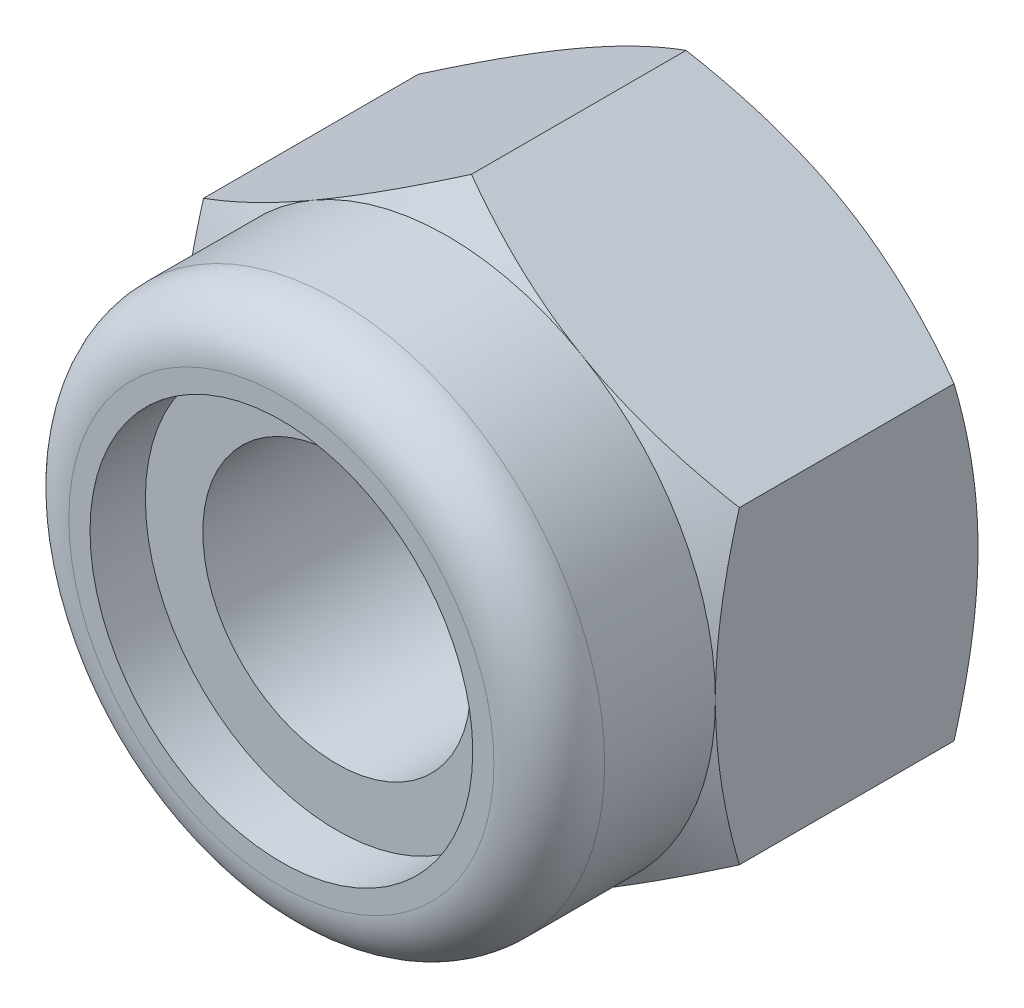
ISO-10303-21;
HEADER;
FILE_DESCRIPTION(('STEP AP214'),'2;1');
FILE_NAME('part.step','',(''),(''),'','','');
FILE_SCHEMA(('AUTOMOTIVE_DESIGN { 1 0 10303 214 1 1 1 1 }'));
ENDSEC;
DATA;
#1=APPLICATION_CONTEXT('core data for automotive mechanical design processes');
#2=APPLICATION_PROTOCOL_DEFINITION('international standard','automotive_design',2000,#1);
#3=PRODUCT_CONTEXT('',#1,'mechanical');
#4=PRODUCT('Part','Part','',(#3));
#5=PRODUCT_RELATED_PRODUCT_CATEGORY('part','',(#4));
#6=PRODUCT_DEFINITION_FORMATION('','',#4);
#7=PRODUCT_DEFINITION_CONTEXT('part definition',#1,'design');
#8=PRODUCT_DEFINITION('design','',#6,#7);
#9=PRODUCT_DEFINITION_SHAPE('','',#8);
#10=(LENGTH_UNIT() NAMED_UNIT(*) SI_UNIT(.MILLI.,.METRE.));
#11=(NAMED_UNIT(*) PLANE_ANGLE_UNIT() SI_UNIT($,.RADIAN.));
#12=(NAMED_UNIT(*) SI_UNIT($,.STERADIAN.) SOLID_ANGLE_UNIT());
#13=UNCERTAINTY_MEASURE_WITH_UNIT(LENGTH_MEASURE(1.E-05),#10,'distance_accuracy_value','');
#14=(GEOMETRIC_REPRESENTATION_CONTEXT(3) GLOBAL_UNCERTAINTY_ASSIGNED_CONTEXT((#13)) GLOBAL_UNIT_ASSIGNED_CONTEXT((#10,
#11,#12)) REPRESENTATION_CONTEXT('',''));
#15=CARTESIAN_POINT('',(0.,0.,0.));
#16=DIRECTION('',(0.,0.,1.));
#17=DIRECTION('',(1.,0.,0.));
#18=AXIS2_PLACEMENT_3D('',#15,#16,#17);
#19=CARTESIAN_POINT('',(0.,0.,-4.9));
#20=DIRECTION('',(0.,0.,1.));
#21=DIRECTION('',(1.,0.,0.));
#22=AXIS2_PLACEMENT_3D('',#19,#20,#21);
#23=CYLINDRICAL_SURFACE('',#22,2.5);
#24=CARTESIAN_POINT('',(0.,0.,2.06666666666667));
#25=DIRECTION('',(0.,0.,1.));
#26=DIRECTION('',(1.,0.,0.));
#27=AXIS2_PLACEMENT_3D('',#24,#25,#26);
#28=CIRCLE('',#27,2.5);
#29=CARTESIAN_POINT('',(2.5,0.,2.06666666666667));
#30=VERTEX_POINT('',#29);
#31=EDGE_CURVE('E274',#30,#30,#28,.T.);
#32=ORIENTED_EDGE('',*,*,#31,.T.);
#33=EDGE_LOOP('',(#32));
#34=FACE_BOUND('',#33,.T.);
#35=CARTESIAN_POINT('',(0.,0.,-4.52449623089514));
#36=DIRECTION('',(0.,0.,-1.));
#37=DIRECTION('',(-1.,0.,0.));
#38=AXIS2_PLACEMENT_3D('',#35,#36,#37);
#39=CIRCLE('',#38,2.5);
#40=CARTESIAN_POINT('',(-2.5,0.,-4.52449623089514));
#41=VERTEX_POINT('',#40);
#42=EDGE_CURVE('E41',#41,#41,#39,.F.);
#43=ORIENTED_EDGE('',*,*,#42,.F.);
#44=EDGE_LOOP('',(#43));
#45=FACE_BOUND('',#44,.T.);
#46=ADVANCED_FACE('F36',(#34,#45),#23,.F.);
#47=CARTESIAN_POINT('',(0.,5.77350269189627,-4.9));
#48=DIRECTION('',(0.,0.,-1.));
#49=DIRECTION('',(-1.,0.,0.));
#50=AXIS2_PLACEMENT_3D('',#47,#48,#49);
#51=PLANE('',#50);
#52=CARTESIAN_POINT('',(0.,0.,-4.9));
#53=DIRECTION('',(0.,0.,-1.));
#54=DIRECTION('',(-1.,0.,0.));
#55=AXIS2_PLACEMENT_3D('',#52,#53,#54);
#56=CIRCLE('',#55,5.);
#57=CARTESIAN_POINT('',(-5.,0.,-4.9));
#58=VERTEX_POINT('',#57);
#59=CARTESIAN_POINT('',(-2.50000000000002,-4.33012701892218,-4.9));
#60=VERTEX_POINT('',#59);
#61=EDGE_CURVE('E146',#58,#60,#56,.F.);
#62=ORIENTED_EDGE('',*,*,#61,.F.);
#63=CARTESIAN_POINT('',(-2.50000000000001,4.33012701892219,-4.9));
#64=VERTEX_POINT('',#63);
#65=EDGE_CURVE('E236',#64,#58,#56,.F.);
#66=ORIENTED_EDGE('',*,*,#65,.F.);
#67=CARTESIAN_POINT('',(2.50000000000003,4.33012701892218,-4.9));
#68=VERTEX_POINT('',#67);
#69=EDGE_CURVE('E251',#68,#64,#56,.F.);
#70=ORIENTED_EDGE('',*,*,#69,.F.);
#71=CARTESIAN_POINT('',(0.,0.,-4.9));
#72=DIRECTION('',(0.,0.,1.));
#73=DIRECTION('',(1.,0.,0.));
#74=AXIS2_PLACEMENT_3D('',#71,#72,#73);
#75=CIRCLE('',#74,5.);
#76=CARTESIAN_POINT('',(5.,0.,-4.9));
#77=VERTEX_POINT('',#76);
#78=EDGE_CURVE('E208',#77,#68,#75,.T.);
#79=ORIENTED_EDGE('',*,*,#78,.F.);
#80=CARTESIAN_POINT('',(2.50000000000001,-4.33012701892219,-4.9));
#81=VERTEX_POINT('',#80);
#82=EDGE_CURVE('E405',#81,#77,#56,.F.);
#83=ORIENTED_EDGE('',*,*,#82,.F.);
#84=EDGE_CURVE('E323',#60,#81,#56,.F.);
#85=ORIENTED_EDGE('',*,*,#84,.F.);
#86=EDGE_LOOP('',(#62,#66,#70,#79,#83,#85));
#87=FACE_BOUND('',#86,.T.);
#88=CARTESIAN_POINT('',(0.,0.,-4.9));
#89=DIRECTION('',(0.,0.,-1.));
#90=DIRECTION('',(-1.,0.,0.));
#91=AXIS2_PLACEMENT_3D('',#88,#89,#90);
#92=CIRCLE('',#91,3.);
#93=CARTESIAN_POINT('',(-3.,0.,-4.9));
#94=VERTEX_POINT('',#93);
#95=EDGE_CURVE('E252',#94,#94,#92,.F.);
#96=ORIENTED_EDGE('',*,*,#95,.T.);
#97=EDGE_LOOP('',(#96));
#98=FACE_BOUND('',#97,.T.);
#99=ADVANCED_FACE('F216',(#87,#98),#51,.T.);
#100=CARTESIAN_POINT('',(0.,5.77350269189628,-4.9));
#101=DIRECTION('',(-0.500000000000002,0.866025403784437,0.));
#102=DIRECTION('',(-0.866025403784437,-0.500000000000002,0.));
#103=AXIS2_PLACEMENT_3D('',#100,#101,#102);
#104=PLANE('',#103);
#105=DIRECTION('',(0.,0.,1.));
#106=VECTOR('',#105,1.);
#107=CARTESIAN_POINT('',(-5.,2.88675134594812,-4.9));
#108=LINE('',#107,#106);
#109=CARTESIAN_POINT('',(-5.,2.88675134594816,-4.45341801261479));
#110=VERTEX_POINT('',#109);
#111=CARTESIAN_POINT('',(-5.,2.88675134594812,-0.446581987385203));
#112=VERTEX_POINT('',#111);
#113=EDGE_CURVE('E247',#110,#112,#108,.T.);
#114=ORIENTED_EDGE('',*,*,#113,.T.);
#115=CARTESIAN_POINT('',(-5.0002,2.88663587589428,-0.44664865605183));
#116=CARTESIAN_POINT('',(-4.78046540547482,3.01349970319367,-0.373386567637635));
#117=CARTESIAN_POINT('',(-4.55885141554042,3.14144859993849,-0.306751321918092));
#118=CARTESIAN_POINT('',(-4.11178600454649,3.3995619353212,-0.190438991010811));
#119=CARTESIAN_POINT('',(-3.88632664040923,3.52973095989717,-0.140803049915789));
#120=CARTESIAN_POINT('',(-3.43816769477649,3.78847564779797,-0.063551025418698));
#121=CARTESIAN_POINT('',(-3.21553790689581,3.91701101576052,-0.0354203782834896));
#122=CARTESIAN_POINT('',(-2.88081009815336,4.11026620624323,-0.0101949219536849));
#123=CARTESIAN_POINT('',(-2.76915780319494,4.17472868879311,-0.0046134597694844));
#124=CARTESIAN_POINT('',(-2.5457500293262,4.30371322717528,0.000797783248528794));
#125=CARTESIAN_POINT('',(-2.43399455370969,4.36823528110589,0.000627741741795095));
#126=CARTESIAN_POINT('',(-2.12781576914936,4.54500768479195,-0.00775363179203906));
#127=CARTESIAN_POINT('',(-1.93349391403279,4.65719946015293,-0.0218297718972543));
#128=CARTESIAN_POINT('',(-1.54613989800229,4.88083840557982,-0.0664652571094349));
#129=CARTESIAN_POINT('',(-1.35310909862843,4.99228478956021,-0.0970398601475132));
#130=CARTESIAN_POINT('',(-0.96497465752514,5.21637431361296,-0.173468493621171));
#131=CARTESIAN_POINT('',(-0.769920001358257,5.3289891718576,-0.219646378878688));
#132=CARTESIAN_POINT('',(-0.382719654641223,5.552539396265,-0.324451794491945));
#133=CARTESIAN_POINT('',(-0.190569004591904,5.66347762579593,-0.383054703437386));
#134=CARTESIAN_POINT('',(0.000200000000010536,5.77361816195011,-0.446648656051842));
#135=B_SPLINE_CURVE_WITH_KNOTS('',3,(#115,#116,#117,#118,#119,#120,#121,#122,#123,#124,#125,
#126,#127,#128,#129,#130,#131,#132,#133,#134),.UNSPECIFIED.,.F.,.F.,(4,2,2,2,2,2,2,2,2,4),(0.,
0.792555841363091,1.58701660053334,2.36181537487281,2.74884076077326,3.13585419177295,
3.8096236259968,4.48401723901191,5.17336882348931,5.86136694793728),.UNSPECIFIED.);
#136=CARTESIAN_POINT('',(-2.50000000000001,4.33012701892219,0.));
#137=VERTEX_POINT('',#136);
#138=EDGE_CURVE('E61',#112,#137,#135,.T.);
#139=ORIENTED_EDGE('',*,*,#138,.T.);
#140=CARTESIAN_POINT('',(0.,5.77350269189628,-0.446581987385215));
#141=VERTEX_POINT('',#140);
#142=EDGE_CURVE('E199',#137,#141,#135,.T.);
#143=ORIENTED_EDGE('',*,*,#142,.T.);
#144=DIRECTION('',(0.,0.,1.));
#145=VECTOR('',#144,1.);
#146=CARTESIAN_POINT('',(0.,5.77350269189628,-4.9));
#147=LINE('',#146,#145);
#148=CARTESIAN_POINT('',(0.,5.77350269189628,-4.45341801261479));
#149=VERTEX_POINT('',#148);
#150=EDGE_CURVE('E233',#149,#141,#147,.T.);
#151=ORIENTED_EDGE('',*,*,#150,.F.);
#152=CARTESIAN_POINT('',(-5.0002,2.88663587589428,-4.45335134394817));
#153=CARTESIAN_POINT('',(-4.78046540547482,3.01349970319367,-4.52661343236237));
#154=CARTESIAN_POINT('',(-4.55885141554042,3.14144859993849,-4.59324867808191));
#155=CARTESIAN_POINT('',(-4.11178600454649,3.3995619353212,-4.70956100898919));
#156=CARTESIAN_POINT('',(-3.88632664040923,3.52973095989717,-4.75919695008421));
#157=CARTESIAN_POINT('',(-3.43816769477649,3.78847564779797,-4.8364489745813));
#158=CARTESIAN_POINT('',(-3.21553790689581,3.91701101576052,-4.86457962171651));
#159=CARTESIAN_POINT('',(-2.88081009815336,4.11026620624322,-4.88980507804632));
#160=CARTESIAN_POINT('',(-2.76915780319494,4.17472868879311,-4.89538654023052));
#161=CARTESIAN_POINT('',(-2.5457500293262,4.30371322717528,-4.90079778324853));
#162=CARTESIAN_POINT('',(-2.43399455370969,4.36823528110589,-4.9006277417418));
#163=CARTESIAN_POINT('',(-2.12781576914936,4.54500768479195,-4.89224636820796));
#164=CARTESIAN_POINT('',(-1.93349391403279,4.65719946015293,-4.87817022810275));
#165=CARTESIAN_POINT('',(-1.54613989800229,4.88083840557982,-4.83353474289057));
#166=CARTESIAN_POINT('',(-1.35310909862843,4.99228478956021,-4.80296013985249));
#167=CARTESIAN_POINT('',(-0.96497465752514,5.21637431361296,-4.72653150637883));
#168=CARTESIAN_POINT('',(-0.769920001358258,5.3289891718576,-4.68035362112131));
#169=CARTESIAN_POINT('',(-0.382719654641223,5.552539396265,-4.57554820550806));
#170=CARTESIAN_POINT('',(-0.190569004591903,5.66347762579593,-4.51694529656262));
#171=CARTESIAN_POINT('',(0.000200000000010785,5.77361816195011,-4.45335134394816));
#172=B_SPLINE_CURVE_WITH_KNOTS('',3,(#152,#153,#154,#155,#156,#157,#158,#159,#160,#161,#162,
#163,#164,#165,#166,#167,#168,#169,#170,#171),.UNSPECIFIED.,.F.,.F.,(4,2,2,2,2,2,2,2,2,4),(0.,
0.792555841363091,1.58701660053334,2.36181537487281,2.74884076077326,3.13585419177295,
3.8096236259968,4.48401723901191,5.1733688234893,5.86136694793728),.UNSPECIFIED.);
#173=EDGE_CURVE('E249',#64,#149,#172,.T.);
#174=ORIENTED_EDGE('',*,*,#173,.F.);
#175=EDGE_CURVE('E228',#110,#64,#172,.T.);
#176=ORIENTED_EDGE('',*,*,#175,.F.);
#177=EDGE_LOOP('',(#114,#139,#143,#151,#174,#176));
#178=FACE_BOUND('',#177,.T.);
#179=ADVANCED_FACE('F38',(#178),#104,.T.);
#180=CARTESIAN_POINT('',(5.,2.8867513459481,-4.9));
#181=DIRECTION('',(0.500000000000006,0.866025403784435,0.));
#182=DIRECTION('',(-0.866025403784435,0.500000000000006,0.));
#183=AXIS2_PLACEMENT_3D('',#180,#181,#182);
#184=PLANE('',#183);
#185=ORIENTED_EDGE('',*,*,#150,.T.);
#186=CARTESIAN_POINT('',(-0.000199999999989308,5.77361816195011,-0.446648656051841));
#187=CARTESIAN_POINT('',(0.219534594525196,5.64675433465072,-0.373386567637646));
#188=CARTESIAN_POINT('',(0.441148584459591,5.51880543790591,-0.306751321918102));
#189=CARTESIAN_POINT('',(0.888213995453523,5.26069210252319,-0.190438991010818));
#190=CARTESIAN_POINT('',(1.11367335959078,5.13052307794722,-0.140803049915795));
#191=CARTESIAN_POINT('',(1.56183230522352,4.87177839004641,-0.0635510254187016));
#192=CARTESIAN_POINT('',(1.7844620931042,4.74324302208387,-0.0354203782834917));
#193=CARTESIAN_POINT('',(2.11918990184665,4.54998783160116,-0.0101949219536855));
#194=CARTESIAN_POINT('',(2.23084219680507,4.48552534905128,-0.00461345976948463));
#195=CARTESIAN_POINT('',(2.45424997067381,4.35654081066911,0.000797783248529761));
#196=CARTESIAN_POINT('',(2.56600544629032,4.29201875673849,0.000627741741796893));
#197=CARTESIAN_POINT('',(2.87218423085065,4.11524635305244,-0.00775363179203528));
#198=CARTESIAN_POINT('',(3.06650608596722,4.00305457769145,-0.0218297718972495));
#199=CARTESIAN_POINT('',(3.45386010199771,3.77941563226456,-0.0664652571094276));
#200=CARTESIAN_POINT('',(3.64689090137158,3.66796924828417,-0.0970398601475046));
#201=CARTESIAN_POINT('',(4.03502534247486,3.44387972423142,-0.17346849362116));
#202=CARTESIAN_POINT('',(4.23007999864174,3.33126486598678,-0.219646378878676));
#203=CARTESIAN_POINT('',(4.61728034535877,3.10771464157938,-0.324451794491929));
#204=CARTESIAN_POINT('',(4.80943099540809,2.99677641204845,-0.383054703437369));
#205=CARTESIAN_POINT('',(5.0002,2.88663587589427,-0.446648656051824));
#206=B_SPLINE_CURVE_WITH_KNOTS('',3,(#186,#187,#188,#189,#190,#191,#192,#193,#194,#195,#196,
#197,#198,#199,#200,#201,#202,#203,#204,#205),.UNSPECIFIED.,.F.,.F.,(4,2,2,2,2,2,2,2,2,4),(0.,
0.792555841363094,1.58701660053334,2.36181537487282,2.74884076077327,3.13585419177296,
3.8096236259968,4.48401723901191,5.1733688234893,5.86136694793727),.UNSPECIFIED.);
#207=CARTESIAN_POINT('',(2.50000000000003,4.33012701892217,0.));
#208=VERTEX_POINT('',#207);
#209=EDGE_CURVE('E207',#141,#208,#206,.T.);
#210=ORIENTED_EDGE('',*,*,#209,.T.);
#211=CARTESIAN_POINT('',(5.,2.88675134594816,-0.446581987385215));
#212=VERTEX_POINT('',#211);
#213=EDGE_CURVE('E200',#208,#212,#206,.T.);
#214=ORIENTED_EDGE('',*,*,#213,.T.);
#215=DIRECTION('',(0.,0.,1.));
#216=VECTOR('',#215,1.);
#217=CARTESIAN_POINT('',(5.,2.8867513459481,-4.9));
#218=LINE('',#217,#216);
#219=CARTESIAN_POINT('',(5.,2.88675134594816,-4.45341801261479));
#220=VERTEX_POINT('',#219);
#221=EDGE_CURVE('E237',#220,#212,#218,.T.);
#222=ORIENTED_EDGE('',*,*,#221,.F.);
#223=CARTESIAN_POINT('',(-0.000199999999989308,5.77361816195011,-4.45335134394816));
#224=CARTESIAN_POINT('',(0.219534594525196,5.64675433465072,-4.52661343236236));
#225=CARTESIAN_POINT('',(0.441148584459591,5.51880543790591,-4.5932486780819));
#226=CARTESIAN_POINT('',(0.888213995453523,5.26069210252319,-4.70956100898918));
#227=CARTESIAN_POINT('',(1.11367335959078,5.13052307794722,-4.75919695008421));
#228=CARTESIAN_POINT('',(1.56183230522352,4.87177839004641,-4.8364489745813));
#229=CARTESIAN_POINT('',(1.7844620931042,4.74324302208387,-4.86457962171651));
#230=CARTESIAN_POINT('',(2.11918990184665,4.54998783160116,-4.88980507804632));
#231=CARTESIAN_POINT('',(2.23084219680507,4.48552534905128,-4.89538654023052));
#232=CARTESIAN_POINT('',(2.45424997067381,4.35654081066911,-4.90079778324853));
#233=CARTESIAN_POINT('',(2.56600544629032,4.29201875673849,-4.9006277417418));
#234=CARTESIAN_POINT('',(2.87218423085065,4.11524635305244,-4.89224636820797));
#235=CARTESIAN_POINT('',(3.06650608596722,4.00305457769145,-4.87817022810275));
#236=CARTESIAN_POINT('',(3.45386010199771,3.77941563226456,-4.83353474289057));
#237=CARTESIAN_POINT('',(3.64689090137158,3.66796924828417,-4.8029601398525));
#238=CARTESIAN_POINT('',(4.03502534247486,3.44387972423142,-4.72653150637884));
#239=CARTESIAN_POINT('',(4.23007999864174,3.33126486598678,-4.68035362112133));
#240=CARTESIAN_POINT('',(4.61728034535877,3.10771464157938,-4.57554820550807));
#241=CARTESIAN_POINT('',(4.80943099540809,2.99677641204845,-4.51694529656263));
#242=CARTESIAN_POINT('',(5.0002,2.88663587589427,-4.45335134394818));
#243=B_SPLINE_CURVE_WITH_KNOTS('',3,(#223,#224,#225,#226,#227,#228,#229,#230,#231,#232,#233,
#234,#235,#236,#237,#238,#239,#240,#241,#242),.UNSPECIFIED.,.F.,.F.,(4,2,2,2,2,2,2,2,2,4),(0.,
0.792555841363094,1.58701660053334,2.36181537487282,2.74884076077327,3.13585419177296,
3.8096236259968,4.48401723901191,5.1733688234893,5.86136694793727),.UNSPECIFIED.);
#244=EDGE_CURVE('E220',#68,#220,#243,.T.);
#245=ORIENTED_EDGE('',*,*,#244,.F.);
#246=EDGE_CURVE('E226',#149,#68,#243,.T.);
#247=ORIENTED_EDGE('',*,*,#246,.F.);
#248=EDGE_LOOP('',(#185,#210,#214,#222,#245,#247));
#249=FACE_BOUND('',#248,.T.);
#250=ADVANCED_FACE('F210',(#249),#184,.T.);
#251=CARTESIAN_POINT('',(5.,2.8867513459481,-4.9));
#252=DIRECTION('',(-1.,0.,0.));
#253=DIRECTION('',(0.,0.,1.));
#254=AXIS2_PLACEMENT_3D('',#251,#252,#253);
#255=PLANE('',#254);
#256=CARTESIAN_POINT('',(5.,-7.65608998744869,-2.39263352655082));
#257=CARTESIAN_POINT('',(5.,-7.4365617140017,-2.28654533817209));
#258=CARTESIAN_POINT('',(5.,-7.21651440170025,-2.18151175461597));
#259=CARTESIAN_POINT('',(5.,-6.77510105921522,-1.97415643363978));
#260=CARTESIAN_POINT('',(5.,-6.55373480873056,-1.8718351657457));
#261=CARTESIAN_POINT('',(5.,-6.1082071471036,-1.66996807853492));
#262=CARTESIAN_POINT('',(5.,-5.88403698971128,-1.57044149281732));
#263=CARTESIAN_POINT('',(5.,-5.4338541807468,-1.37566323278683));
#264=CARTESIAN_POINT('',(5.,-5.20784162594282,-1.28041133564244));
#265=CARTESIAN_POINT('',(5.,-4.75080884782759,-1.09418830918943));
#266=CARTESIAN_POINT('',(5.,-4.51976121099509,-1.00328409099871));
#267=CARTESIAN_POINT('',(5.,-4.05494053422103,-0.828595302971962));
#268=CARTESIAN_POINT('',(5.,-3.82116719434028,-0.744811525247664));
#269=CARTESIAN_POINT('',(5.,-3.35100416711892,-0.58661463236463));
#270=CARTESIAN_POINT('',(5.,-3.11462125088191,-0.512181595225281));
#271=CARTESIAN_POINT('',(5.,-2.63849247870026,-0.375104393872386));
#272=CARTESIAN_POINT('',(5.,-2.39874771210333,-0.312456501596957));
#273=CARTESIAN_POINT('',(5.,-1.915743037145,-0.201987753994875));
#274=CARTESIAN_POINT('',(5.,-1.67248221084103,-0.154170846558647));
#275=CARTESIAN_POINT('',(5.,-1.18299359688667,-0.0765955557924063));
#276=CARTESIAN_POINT('',(5.,-0.936765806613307,-0.0468371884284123));
#277=CARTESIAN_POINT('',(5.,-0.567032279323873,-0.0176512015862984));
#278=CARTESIAN_POINT('',(5.,-0.444105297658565,-0.0104963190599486));
#279=CARTESIAN_POINT('',(5.,-0.19805300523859,-0.00139545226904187));
#280=CARTESIAN_POINT('',(5.,-0.0749276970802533,0.000550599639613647));
#281=CARTESIAN_POINT('',(5.,0.171257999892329,-0.000818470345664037));
#282=CARTESIAN_POINT('',(5.,0.294318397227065,-0.00413211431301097));
#283=CARTESIAN_POINT('',(5.,0.540192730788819,-0.0159365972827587));
#284=CARTESIAN_POINT('',(5.,0.663006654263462,-0.0244276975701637));
#285=CARTESIAN_POINT('',(5.,0.960681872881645,-0.0511063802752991));
#286=CARTESIAN_POINT('',(5.,1.13531436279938,-0.071888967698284));
#287=CARTESIAN_POINT('',(5.,1.48321675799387,-0.122765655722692));
#288=CARTESIAN_POINT('',(5.,1.65648647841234,-0.15286099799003));
#289=CARTESIAN_POINT('',(5.,2.00155426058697,-0.221298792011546));
#290=CARTESIAN_POINT('',(5.,2.17335067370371,-0.259649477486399));
#291=CARTESIAN_POINT('',(5.,2.51518168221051,-0.343428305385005));
#292=CARTESIAN_POINT('',(5.,2.68521638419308,-0.388856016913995));
#293=CARTESIAN_POINT('',(5.,3.02770318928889,-0.486887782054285));
#294=CARTESIAN_POINT('',(5.,3.20011248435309,-0.539640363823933));
#295=CARTESIAN_POINT('',(5.,3.54310870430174,-0.650357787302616));
#296=CARTESIAN_POINT('',(5.,3.71369679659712,-0.70831903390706));
#297=CARTESIAN_POINT('',(5.,4.05236610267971,-0.828256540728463));
#298=CARTESIAN_POINT('',(5.,4.22045602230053,-0.890208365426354));
#299=CARTESIAN_POINT('',(5.,4.55533171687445,-1.01774823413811));
#300=CARTESIAN_POINT('',(5.,4.72211693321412,-1.08333774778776));
#301=CARTESIAN_POINT('',(5.,4.88829623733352,-1.15038625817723));
#302=B_SPLINE_CURVE_WITH_KNOTS('',3,(#256,#257,#258,#259,#260,#261,#262,#263,#264,#265,#266,
#267,#268,#269,#270,#271,#272,#273,#274,#275,#276,#277,#278,#279,#280,#281,#282,#283,#284,#285,
#286,#287,#288,#289,#290,#291,#292,#293,#294,#295,#296,#297,#298,#299,#300,#301),.UNSPECIFIED.,
.F.,.F.,(4,2,2,2,2,2,2,2,2,2,2,2,2,2,2,2,2,2,2,2,2,2,4),(0.,0.731464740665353,1.46305528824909,
2.19883243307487,2.93457117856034,3.67934251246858,4.42419659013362,5.1674358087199,
5.9104395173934,6.65364083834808,7.39684281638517,7.76615414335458,8.13546067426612,
8.50466345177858,8.87388486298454,9.40118542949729,9.92855633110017,10.4564556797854,
10.9843228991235,11.525120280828,12.065547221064,12.6029322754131,13.1405360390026),.UNSPECIFIED.);
#303=CARTESIAN_POINT('',(5.,-2.88675134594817,-0.446581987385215));
#304=VERTEX_POINT('',#303);
#305=CARTESIAN_POINT('',(5.,0.,0.));
#306=VERTEX_POINT('',#305);
#307=EDGE_CURVE('E189',#304,#306,#302,.T.);
#308=ORIENTED_EDGE('',*,*,#307,.F.);
#309=DIRECTION('',(0.,0.,1.));
#310=VECTOR('',#309,1.);
#311=CARTESIAN_POINT('',(5.,-2.88675134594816,-4.9));
#312=LINE('',#311,#310);
#313=CARTESIAN_POINT('',(5.,-2.88675134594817,-4.45341801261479));
#314=VERTEX_POINT('',#313);
#315=EDGE_CURVE('E240',#314,#304,#312,.T.);
#316=ORIENTED_EDGE('',*,*,#315,.F.);
#317=CARTESIAN_POINT('',(5.,-7.65608998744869,-2.50736647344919));
#318=CARTESIAN_POINT('',(5.,-7.4365617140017,-2.61345466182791));
#319=CARTESIAN_POINT('',(5.,-7.21651440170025,-2.71848824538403));
#320=CARTESIAN_POINT('',(5.,-6.77510105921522,-2.92584356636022));
#321=CARTESIAN_POINT('',(5.,-6.55373480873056,-3.0281648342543));
#322=CARTESIAN_POINT('',(5.,-6.10820714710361,-3.23003192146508));
#323=CARTESIAN_POINT('',(5.,-5.88403698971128,-3.32955850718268));
#324=CARTESIAN_POINT('',(5.,-5.43385418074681,-3.52433676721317));
#325=CARTESIAN_POINT('',(5.,-5.20784162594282,-3.61958866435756));
#326=CARTESIAN_POINT('',(5.,-4.75080884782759,-3.80581169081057));
#327=CARTESIAN_POINT('',(5.,-4.51976121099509,-3.89671590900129));
#328=CARTESIAN_POINT('',(5.,-4.05494053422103,-4.07140469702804));
#329=CARTESIAN_POINT('',(5.,-3.82116719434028,-4.15518847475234));
#330=CARTESIAN_POINT('',(5.,-3.35100416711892,-4.31338536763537));
#331=CARTESIAN_POINT('',(5.,-3.11462125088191,-4.38781840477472));
#332=CARTESIAN_POINT('',(5.,-2.63849247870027,-4.52489560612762));
#333=CARTESIAN_POINT('',(5.,-2.39874771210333,-4.58754349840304));
#334=CARTESIAN_POINT('',(5.,-1.915743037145,-4.69801224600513));
#335=CARTESIAN_POINT('',(5.,-1.67248221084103,-4.74582915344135));
#336=CARTESIAN_POINT('',(5.,-1.18299359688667,-4.8234044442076));
#337=CARTESIAN_POINT('',(5.,-0.936765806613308,-4.85316281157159));
#338=CARTESIAN_POINT('',(5.,-0.567032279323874,-4.8823487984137));
#339=CARTESIAN_POINT('',(5.,-0.444105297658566,-4.88950368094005));
#340=CARTESIAN_POINT('',(5.,-0.19805300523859,-4.89860454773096));
#341=CARTESIAN_POINT('',(5.,-0.0749276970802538,-4.90055059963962));
#342=CARTESIAN_POINT('',(5.,0.171257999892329,-4.89918152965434));
#343=CARTESIAN_POINT('',(5.,0.294318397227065,-4.89586788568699));
#344=CARTESIAN_POINT('',(5.,0.540192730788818,-4.88406340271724));
#345=CARTESIAN_POINT('',(5.,0.663006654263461,-4.87557230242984));
#346=CARTESIAN_POINT('',(5.,0.960681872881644,-4.8488936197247));
#347=CARTESIAN_POINT('',(5.,1.13531436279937,-4.82811103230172));
#348=CARTESIAN_POINT('',(5.,1.48321675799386,-4.77723434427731));
#349=CARTESIAN_POINT('',(5.,1.65648647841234,-4.74713900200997));
#350=CARTESIAN_POINT('',(5.,2.00155426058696,-4.67870120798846));
#351=CARTESIAN_POINT('',(5.,2.1733506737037,-4.6403505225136));
#352=CARTESIAN_POINT('',(5.,2.51518168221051,-4.556571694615));
#353=CARTESIAN_POINT('',(5.,2.68521638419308,-4.51114398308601));
#354=CARTESIAN_POINT('',(5.,3.02770318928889,-4.41311221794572));
#355=CARTESIAN_POINT('',(5.,3.20011248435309,-4.36035963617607));
#356=CARTESIAN_POINT('',(5.,3.54310870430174,-4.24964221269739));
#357=CARTESIAN_POINT('',(5.,3.71369679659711,-4.19168096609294));
#358=CARTESIAN_POINT('',(5.,4.05236610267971,-4.07174345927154));
#359=CARTESIAN_POINT('',(5.,4.22045602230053,-4.00979163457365));
#360=CARTESIAN_POINT('',(5.,4.55533171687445,-3.88225176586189));
#361=CARTESIAN_POINT('',(5.,4.72211693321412,-3.81666225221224));
#362=CARTESIAN_POINT('',(5.,4.88829623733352,-3.74961374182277));
#363=B_SPLINE_CURVE_WITH_KNOTS('',3,(#317,#318,#319,#320,#321,#322,#323,#324,#325,#326,#327,
#328,#329,#330,#331,#332,#333,#334,#335,#336,#337,#338,#339,#340,#341,#342,#343,#344,#345,#346,
#347,#348,#349,#350,#351,#352,#353,#354,#355,#356,#357,#358,#359,#360,#361,#362),.UNSPECIFIED.,
.F.,.F.,(4,2,2,2,2,2,2,2,2,2,2,2,2,2,2,2,2,2,2,2,2,2,4),(0.,0.731464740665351,1.46305528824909,
2.19883243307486,2.93457117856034,3.67934251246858,4.42419659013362,5.1674358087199,
5.9104395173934,6.65364083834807,7.39684281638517,7.76615414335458,8.13546067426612,
8.50466345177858,8.87388486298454,9.40118542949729,9.92855633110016,10.4564556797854,
10.9843228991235,11.525120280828,12.065547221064,12.6029322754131,13.1405360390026),.UNSPECIFIED.);
#364=EDGE_CURVE('E373',#314,#77,#363,.T.);
#365=ORIENTED_EDGE('',*,*,#364,.T.);
#366=EDGE_CURVE('E227',#77,#220,#363,.T.);
#367=ORIENTED_EDGE('',*,*,#366,.T.);
#368=ORIENTED_EDGE('',*,*,#221,.T.);
#369=EDGE_CURVE('E198',#306,#212,#302,.T.);
#370=ORIENTED_EDGE('',*,*,#369,.F.);
#371=EDGE_LOOP('',(#308,#316,#365,#367,#368,#370));
#372=FACE_BOUND('',#371,.T.);
#373=ADVANCED_FACE('F214',(#372),#255,.F.);
#374=CARTESIAN_POINT('',(0.,-5.7735026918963,-4.9));
#375=DIRECTION('',(0.500000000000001,-0.866025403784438,0.));
#376=DIRECTION('',(0.866025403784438,0.500000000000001,0.));
#377=AXIS2_PLACEMENT_3D('',#374,#375,#376);
#378=PLANE('',#377);
#379=ORIENTED_EDGE('',*,*,#315,.T.);
#380=CARTESIAN_POINT('',(5.0002,-2.88663587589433,-0.446648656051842));
#381=CARTESIAN_POINT('',(4.78046540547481,-3.01349970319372,-0.373386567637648));
#382=CARTESIAN_POINT('',(4.55885141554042,-3.14144859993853,-0.306751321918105));
#383=CARTESIAN_POINT('',(4.11178600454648,-3.39956193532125,-0.190438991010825));
#384=CARTESIAN_POINT('',(3.88632664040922,-3.52973095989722,-0.140803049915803));
#385=CARTESIAN_POINT('',(3.43816769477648,-3.78847564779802,-0.0635510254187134));
#386=CARTESIAN_POINT('',(3.2155379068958,-3.91701101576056,-0.0354203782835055));
#387=CARTESIAN_POINT('',(2.88081009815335,-4.11026620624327,-0.0101949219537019));
#388=CARTESIAN_POINT('',(2.76915780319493,-4.17472868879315,-0.00461345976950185));
#389=CARTESIAN_POINT('',(2.54575002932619,-4.30371322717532,0.000797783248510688));
#390=CARTESIAN_POINT('',(2.43399455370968,-4.36823528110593,0.000627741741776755));
#391=CARTESIAN_POINT('',(2.12781576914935,-4.54500768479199,-0.00775363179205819));
#392=CARTESIAN_POINT('',(1.93349391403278,-4.65719946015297,-0.0218297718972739));
#393=CARTESIAN_POINT('',(1.54613989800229,-4.88083840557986,-0.0664652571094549));
#394=CARTESIAN_POINT('',(1.35310909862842,-4.99228478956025,-0.0970398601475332));
#395=CARTESIAN_POINT('',(0.964974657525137,-5.21637431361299,-0.17346849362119));
#396=CARTESIAN_POINT('',(0.769920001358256,-5.32898917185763,-0.219646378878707));
#397=CARTESIAN_POINT('',(0.382719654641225,-5.55253939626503,-0.324451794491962));
#398=CARTESIAN_POINT('',(0.190569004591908,-5.66347762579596,-0.383054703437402));
#399=CARTESIAN_POINT('',(-0.000200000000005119,-5.77361816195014,-0.446648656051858));
#400=B_SPLINE_CURVE_WITH_KNOTS('',3,(#380,#381,#382,#383,#384,#385,#386,#387,#388,#389,#390,
#391,#392,#393,#394,#395,#396,#397,#398,#399),.UNSPECIFIED.,.F.,.F.,(4,2,2,2,2,2,2,2,2,4),(0.,
0.792555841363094,1.58701660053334,2.36181537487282,2.74884076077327,3.13585419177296,
3.80962362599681,4.48401723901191,5.1733688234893,5.86136694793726),.UNSPECIFIED.);
#401=CARTESIAN_POINT('',(2.5,-4.33012701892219,0.));
#402=VERTEX_POINT('',#401);
#403=EDGE_CURVE('E367',#304,#402,#400,.T.);
#404=ORIENTED_EDGE('',*,*,#403,.T.);
#405=CARTESIAN_POINT('',(0.,-5.77350269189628,-0.446581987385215));
#406=VERTEX_POINT('',#405);
#407=EDGE_CURVE('E183',#402,#406,#400,.T.);
#408=ORIENTED_EDGE('',*,*,#407,.T.);
#409=DIRECTION('',(0.,0.,1.));
#410=VECTOR('',#409,1.);
#411=CARTESIAN_POINT('',(0.,-5.7735026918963,-4.9));
#412=LINE('',#411,#410);
#413=CARTESIAN_POINT('',(0.,-5.77350269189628,-4.45341801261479));
#414=VERTEX_POINT('',#413);
#415=EDGE_CURVE('E243',#414,#406,#412,.T.);
#416=ORIENTED_EDGE('',*,*,#415,.F.);
#417=CARTESIAN_POINT('',(5.0002,-2.88663587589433,-4.45335134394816));
#418=CARTESIAN_POINT('',(4.78046540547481,-3.01349970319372,-4.52661343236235));
#419=CARTESIAN_POINT('',(4.55885141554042,-3.14144859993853,-4.5932486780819));
#420=CARTESIAN_POINT('',(4.11178600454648,-3.39956193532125,-4.70956100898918));
#421=CARTESIAN_POINT('',(3.88632664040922,-3.52973095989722,-4.7591969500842));
#422=CARTESIAN_POINT('',(3.43816769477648,-3.78847564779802,-4.83644897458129));
#423=CARTESIAN_POINT('',(3.2155379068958,-3.91701101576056,-4.8645796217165));
#424=CARTESIAN_POINT('',(2.88081009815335,-4.11026620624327,-4.8898050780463));
#425=CARTESIAN_POINT('',(2.76915780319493,-4.17472868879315,-4.8953865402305));
#426=CARTESIAN_POINT('',(2.54575002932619,-4.30371322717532,-4.90079778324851));
#427=CARTESIAN_POINT('',(2.43399455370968,-4.36823528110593,-4.90062774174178));
#428=CARTESIAN_POINT('',(2.12781576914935,-4.54500768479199,-4.89224636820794));
#429=CARTESIAN_POINT('',(1.93349391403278,-4.65719946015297,-4.87817022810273));
#430=CARTESIAN_POINT('',(1.54613989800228,-4.88083840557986,-4.83353474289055));
#431=CARTESIAN_POINT('',(1.35310909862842,-4.99228478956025,-4.80296013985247));
#432=CARTESIAN_POINT('',(0.964974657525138,-5.21637431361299,-4.72653150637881));
#433=CARTESIAN_POINT('',(0.769920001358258,-5.32898917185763,-4.68035362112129));
#434=CARTESIAN_POINT('',(0.382719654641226,-5.55253939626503,-4.57554820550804));
#435=CARTESIAN_POINT('',(0.190569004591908,-5.66347762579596,-4.5169452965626));
#436=CARTESIAN_POINT('',(-0.000200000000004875,-5.77361816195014,-4.45335134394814));
#437=B_SPLINE_CURVE_WITH_KNOTS('',3,(#417,#418,#419,#420,#421,#422,#423,#424,#425,#426,#427,
#428,#429,#430,#431,#432,#433,#434,#435,#436),.UNSPECIFIED.,.F.,.F.,(4,2,2,2,2,2,2,2,2,4),(0.,
0.792555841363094,1.58701660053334,2.36181537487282,2.74884076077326,3.13585419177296,
3.80962362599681,4.4840172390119,5.1733688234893,5.86136694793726),.UNSPECIFIED.);
#438=EDGE_CURVE('E345',#81,#414,#437,.T.);
#439=ORIENTED_EDGE('',*,*,#438,.F.);
#440=EDGE_CURVE('E369',#314,#81,#437,.T.);
#441=ORIENTED_EDGE('',*,*,#440,.F.);
#442=EDGE_LOOP('',(#379,#404,#408,#416,#439,#441));
#443=FACE_BOUND('',#442,.T.);
#444=ADVANCED_FACE('F352',(#443),#378,.T.);
#445=CARTESIAN_POINT('',(-5.,-2.88675134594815,-4.9));
#446=DIRECTION('',(-0.500000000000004,-0.866025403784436,0.));
#447=DIRECTION('',(0.866025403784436,-0.500000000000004,0.));
#448=AXIS2_PLACEMENT_3D('',#445,#446,#447);
#449=PLANE('',#448);
#450=ORIENTED_EDGE('',*,*,#415,.T.);
#451=CARTESIAN_POINT('',(0.000199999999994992,-5.77361816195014,-0.446648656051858));
#452=CARTESIAN_POINT('',(-0.219534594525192,-5.64675433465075,-0.373386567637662));
#453=CARTESIAN_POINT('',(-0.441148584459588,-5.51880543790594,-0.306751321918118));
#454=CARTESIAN_POINT('',(-0.888213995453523,-5.26069210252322,-0.190438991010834));
#455=CARTESIAN_POINT('',(-1.11367335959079,-5.13052307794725,-0.140803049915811));
#456=CARTESIAN_POINT('',(-1.56183230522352,-4.87177839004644,-0.0635510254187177));
#457=CARTESIAN_POINT('',(-1.78446209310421,-4.7432430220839,-0.0354203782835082));
#458=CARTESIAN_POINT('',(-2.11918990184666,-4.54998783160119,-0.0101949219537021));
#459=CARTESIAN_POINT('',(-2.23084219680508,-4.4855253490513,-0.00461345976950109));
#460=CARTESIAN_POINT('',(-2.45424997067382,-4.35654081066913,0.000797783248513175));
#461=CARTESIAN_POINT('',(-2.56600544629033,-4.29201875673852,0.000627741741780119));
#462=CARTESIAN_POINT('',(-2.87218423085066,-4.11524635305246,-0.00775363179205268));
#463=CARTESIAN_POINT('',(-3.06650608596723,-4.00305457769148,-0.0218297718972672));
#464=CARTESIAN_POINT('',(-3.45386010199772,-3.77941563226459,-0.0664652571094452));
#465=CARTESIAN_POINT('',(-3.64689090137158,-3.6679692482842,-0.0970398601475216));
#466=CARTESIAN_POINT('',(-4.03502534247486,-3.44387972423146,-0.173468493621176));
#467=CARTESIAN_POINT('',(-4.23007999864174,-3.33126486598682,-0.219646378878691));
#468=CARTESIAN_POINT('',(-4.61728034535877,-3.10771464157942,-0.324451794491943));
#469=CARTESIAN_POINT('',(-4.80943099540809,-2.99677641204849,-0.383054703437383));
#470=CARTESIAN_POINT('',(-5.0002,-2.88663587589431,-0.446648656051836));
#471=B_SPLINE_CURVE_WITH_KNOTS('',3,(#451,#452,#453,#454,#455,#456,#457,#458,#459,#460,#461,
#462,#463,#464,#465,#466,#467,#468,#469,#470),.UNSPECIFIED.,.F.,.F.,(4,2,2,2,2,2,2,2,2,4),(0.,
0.792555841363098,1.58701660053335,2.36181537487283,2.74884076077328,3.13585419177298,
3.80962362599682,4.48401723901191,5.1733688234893,5.86136694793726),.UNSPECIFIED.);
#472=CARTESIAN_POINT('',(-2.50000000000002,-4.33012701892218,0.));
#473=VERTEX_POINT('',#472);
#474=EDGE_CURVE('E152',#406,#473,#471,.T.);
#475=ORIENTED_EDGE('',*,*,#474,.T.);
#476=CARTESIAN_POINT('',(-5.,-2.88675134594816,-0.446581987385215));
#477=VERTEX_POINT('',#476);
#478=EDGE_CURVE('E143',#473,#477,#471,.T.);
#479=ORIENTED_EDGE('',*,*,#478,.T.);
#480=DIRECTION('',(0.,0.,1.));
#481=VECTOR('',#480,1.);
#482=CARTESIAN_POINT('',(-5.,-2.88675134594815,-4.9));
#483=LINE('',#482,#481);
#484=CARTESIAN_POINT('',(-5.,-2.88675134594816,-4.45341801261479));
#485=VERTEX_POINT('',#484);
#486=EDGE_CURVE('E151',#485,#477,#483,.T.);
#487=ORIENTED_EDGE('',*,*,#486,.F.);
#488=CARTESIAN_POINT('',(0.000199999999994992,-5.77361816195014,-4.45335134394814));
#489=CARTESIAN_POINT('',(-0.219534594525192,-5.64675433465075,-4.52661343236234));
#490=CARTESIAN_POINT('',(-0.441148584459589,-5.51880543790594,-4.59324867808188));
#491=CARTESIAN_POINT('',(-0.888213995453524,-5.26069210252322,-4.70956100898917));
#492=CARTESIAN_POINT('',(-1.11367335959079,-5.13052307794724,-4.75919695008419));
#493=CARTESIAN_POINT('',(-1.56183230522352,-4.87177839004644,-4.83644897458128));
#494=CARTESIAN_POINT('',(-1.78446209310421,-4.7432430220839,-4.86457962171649));
#495=CARTESIAN_POINT('',(-2.11918990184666,-4.54998783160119,-4.8898050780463));
#496=CARTESIAN_POINT('',(-2.23084219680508,-4.4855253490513,-4.8953865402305));
#497=CARTESIAN_POINT('',(-2.45424997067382,-4.35654081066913,-4.90079778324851));
#498=CARTESIAN_POINT('',(-2.56600544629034,-4.29201875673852,-4.90062774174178));
#499=CARTESIAN_POINT('',(-2.87218423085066,-4.11524635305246,-4.89224636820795));
#500=CARTESIAN_POINT('',(-3.06650608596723,-4.00305457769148,-4.87817022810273));
#501=CARTESIAN_POINT('',(-3.45386010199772,-3.77941563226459,-4.83353474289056));
#502=CARTESIAN_POINT('',(-3.64689090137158,-3.6679692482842,-4.80296013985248));
#503=CARTESIAN_POINT('',(-4.03502534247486,-3.44387972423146,-4.72653150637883));
#504=CARTESIAN_POINT('',(-4.23007999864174,-3.33126486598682,-4.68035362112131));
#505=CARTESIAN_POINT('',(-4.61728034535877,-3.10771464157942,-4.57554820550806));
#506=CARTESIAN_POINT('',(-4.80943099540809,-2.99677641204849,-4.51694529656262));
#507=CARTESIAN_POINT('',(-5.0002,-2.88663587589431,-4.45335134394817));
#508=B_SPLINE_CURVE_WITH_KNOTS('',3,(#488,#489,#490,#491,#492,#493,#494,#495,#496,#497,#498,
#499,#500,#501,#502,#503,#504,#505,#506,#507),.UNSPECIFIED.,.F.,.F.,(4,2,2,2,2,2,2,2,2,4),(0.,
0.792555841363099,1.58701660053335,2.36181537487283,2.74884076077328,3.13585419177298,
3.80962362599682,4.48401723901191,5.1733688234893,5.86136694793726),.UNSPECIFIED.);
#509=EDGE_CURVE('E334',#60,#485,#508,.T.);
#510=ORIENTED_EDGE('',*,*,#509,.F.);
#511=EDGE_CURVE('E344',#414,#60,#508,.T.);
#512=ORIENTED_EDGE('',*,*,#511,.F.);
#513=EDGE_LOOP('',(#450,#475,#479,#487,#510,#512));
#514=FACE_BOUND('',#513,.T.);
#515=ADVANCED_FACE('F349',(#514),#449,.T.);
#516=CARTESIAN_POINT('',(-5.,2.88675134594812,-4.9));
#517=DIRECTION('',(-1.,0.,0.));
#518=DIRECTION('',(0.,0.,1.));
#519=AXIS2_PLACEMENT_3D('',#516,#517,#518);
#520=PLANE('',#519);
#521=ORIENTED_EDGE('',*,*,#486,.T.);
#522=CARTESIAN_POINT('',(-5.,-7.65608998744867,-2.39263352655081));
#523=CARTESIAN_POINT('',(-5.,-7.43656171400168,-2.28654533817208));
#524=CARTESIAN_POINT('',(-5.,-7.21651440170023,-2.18151175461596));
#525=CARTESIAN_POINT('',(-5.,-6.7751010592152,-1.97415643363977));
#526=CARTESIAN_POINT('',(-5.,-6.55373480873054,-1.87183516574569));
#527=CARTESIAN_POINT('',(-5.,-6.10820714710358,-1.66996807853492));
#528=CARTESIAN_POINT('',(-5.,-5.88403698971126,-1.57044149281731));
#529=CARTESIAN_POINT('',(-5.,-5.43385418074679,-1.37566323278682));
#530=CARTESIAN_POINT('',(-5.,-5.2078416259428,-1.28041133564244));
#531=CARTESIAN_POINT('',(-5.,-4.75080884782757,-1.09418830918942));
#532=CARTESIAN_POINT('',(-5.,-4.51976121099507,-1.0032840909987));
#533=CARTESIAN_POINT('',(-5.,-4.05494053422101,-0.828595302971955));
#534=CARTESIAN_POINT('',(-5.,-3.82116719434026,-0.744811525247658));
#535=CARTESIAN_POINT('',(-5.,-3.35100416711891,-0.586614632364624));
#536=CARTESIAN_POINT('',(-5.,-3.11462125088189,-0.512181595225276));
#537=CARTESIAN_POINT('',(-5.,-2.63849247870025,-0.375104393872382));
#538=CARTESIAN_POINT('',(-5.,-2.39874771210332,-0.312456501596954));
#539=CARTESIAN_POINT('',(-5.,-1.91574303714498,-0.201987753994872));
#540=CARTESIAN_POINT('',(-5.,-1.67248221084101,-0.154170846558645));
#541=CARTESIAN_POINT('',(-5.,-1.18299359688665,-0.0765955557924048));
#542=CARTESIAN_POINT('',(-5.,-0.936765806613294,-0.0468371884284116));
#543=CARTESIAN_POINT('',(-5.,-0.567032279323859,-0.017651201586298));
#544=CARTESIAN_POINT('',(-5.,-0.444105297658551,-0.010496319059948));
#545=CARTESIAN_POINT('',(-5.,-0.198053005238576,-0.00139545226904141));
#546=CARTESIAN_POINT('',(-5.,-0.0749276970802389,0.000550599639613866));
#547=CARTESIAN_POINT('',(-5.,0.171257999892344,-0.000818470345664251));
#548=CARTESIAN_POINT('',(-5.,0.294318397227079,-0.00413211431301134));
#549=CARTESIAN_POINT('',(-5.,0.540192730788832,-0.0159365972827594));
#550=CARTESIAN_POINT('',(-5.,0.663006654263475,-0.0244276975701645));
#551=CARTESIAN_POINT('',(-5.,0.960681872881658,-0.0511063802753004));
#552=CARTESIAN_POINT('',(-5.,1.13531436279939,-0.0718889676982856));
#553=CARTESIAN_POINT('',(-5.,1.48321675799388,-0.122765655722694));
#554=CARTESIAN_POINT('',(-5.,1.65648647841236,-0.152860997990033));
#555=CARTESIAN_POINT('',(-5.,2.00155426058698,-0.22129879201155));
#556=CARTESIAN_POINT('',(-5.,2.17335067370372,-0.259649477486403));
#557=CARTESIAN_POINT('',(-5.,2.51518168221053,-0.34342830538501));
#558=CARTESIAN_POINT('',(-5.,2.6852163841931,-0.388856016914));
#559=CARTESIAN_POINT('',(-5.,3.02770318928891,-0.48688778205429));
#560=CARTESIAN_POINT('',(-5.,3.20011248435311,-0.53964036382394));
#561=CARTESIAN_POINT('',(-5.,3.54310870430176,-0.650357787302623));
#562=CARTESIAN_POINT('',(-5.,3.71369679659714,-0.708319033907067));
#563=CARTESIAN_POINT('',(-5.,4.05236610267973,-0.828256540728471));
#564=CARTESIAN_POINT('',(-5.,4.22045602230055,-0.890208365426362));
#565=CARTESIAN_POINT('',(-5.,4.55533171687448,-1.01774823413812));
#566=CARTESIAN_POINT('',(-5.,4.72211693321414,-1.08333774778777));
#567=CARTESIAN_POINT('',(-5.,4.88829623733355,-1.15038625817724));
#568=B_SPLINE_CURVE_WITH_KNOTS('',3,(#522,#523,#524,#525,#526,#527,#528,#529,#530,#531,#532,
#533,#534,#535,#536,#537,#538,#539,#540,#541,#542,#543,#544,#545,#546,#547,#548,#549,#550,#551,
#552,#553,#554,#555,#556,#557,#558,#559,#560,#561,#562,#563,#564,#565,#566,#567),.UNSPECIFIED.,
.F.,.F.,(4,2,2,2,2,2,2,2,2,2,2,2,2,2,2,2,2,2,2,2,2,2,4),(0.,0.731464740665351,1.46305528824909,
2.19883243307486,2.93457117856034,3.67934251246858,4.42419659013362,5.1674358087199,
5.91043951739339,6.65364083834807,7.39684281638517,7.76615414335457,8.13546067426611,
8.50466345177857,8.87388486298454,9.40118542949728,9.92855633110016,10.4564556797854,
10.9843228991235,11.525120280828,12.065547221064,12.6029322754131,13.1405360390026),.UNSPECIFIED.);
#569=CARTESIAN_POINT('',(-5.,0.,0.));
#570=VERTEX_POINT('',#569);
#571=EDGE_CURVE('E136',#477,#570,#568,.T.);
#572=ORIENTED_EDGE('',*,*,#571,.T.);
#573=EDGE_CURVE('E130',#570,#112,#568,.T.);
#574=ORIENTED_EDGE('',*,*,#573,.T.);
#575=ORIENTED_EDGE('',*,*,#113,.F.);
#576=CARTESIAN_POINT('',(-5.,-7.65608998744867,-2.50736647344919));
#577=CARTESIAN_POINT('',(-5.,-7.43656171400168,-2.61345466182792));
#578=CARTESIAN_POINT('',(-5.,-7.21651440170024,-2.71848824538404));
#579=CARTESIAN_POINT('',(-5.,-6.7751010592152,-2.92584356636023));
#580=CARTESIAN_POINT('',(-5.,-6.55373480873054,-3.02816483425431));
#581=CARTESIAN_POINT('',(-5.,-6.10820714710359,-3.23003192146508));
#582=CARTESIAN_POINT('',(-5.,-5.88403698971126,-3.32955850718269));
#583=CARTESIAN_POINT('',(-5.,-5.43385418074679,-3.52433676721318));
#584=CARTESIAN_POINT('',(-5.,-5.2078416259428,-3.61958866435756));
#585=CARTESIAN_POINT('',(-5.,-4.75080884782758,-3.80581169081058));
#586=CARTESIAN_POINT('',(-5.,-4.51976121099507,-3.8967159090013));
#587=CARTESIAN_POINT('',(-5.,-4.05494053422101,-4.07140469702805));
#588=CARTESIAN_POINT('',(-5.,-3.82116719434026,-4.15518847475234));
#589=CARTESIAN_POINT('',(-5.,-3.35100416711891,-4.31338536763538));
#590=CARTESIAN_POINT('',(-5.,-3.11462125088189,-4.38781840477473));
#591=CARTESIAN_POINT('',(-5.,-2.63849247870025,-4.52489560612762));
#592=CARTESIAN_POINT('',(-5.,-2.39874771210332,-4.58754349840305));
#593=CARTESIAN_POINT('',(-5.,-1.91574303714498,-4.69801224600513));
#594=CARTESIAN_POINT('',(-5.,-1.67248221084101,-4.74582915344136));
#595=CARTESIAN_POINT('',(-5.,-1.18299359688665,-4.8234044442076));
#596=CARTESIAN_POINT('',(-5.,-0.936765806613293,-4.85316281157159));
#597=CARTESIAN_POINT('',(-5.,-0.567032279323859,-4.8823487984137));
#598=CARTESIAN_POINT('',(-5.,-0.44410529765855,-4.88950368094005));
#599=CARTESIAN_POINT('',(-5.,-0.198053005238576,-4.89860454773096));
#600=CARTESIAN_POINT('',(-5.,-0.0749276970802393,-4.90055059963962));
#601=CARTESIAN_POINT('',(-5.,0.171257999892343,-4.89918152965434));
#602=CARTESIAN_POINT('',(-5.,0.294318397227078,-4.89586788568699));
#603=CARTESIAN_POINT('',(-5.,0.540192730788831,-4.88406340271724));
#604=CARTESIAN_POINT('',(-5.,0.663006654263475,-4.87557230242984));
#605=CARTESIAN_POINT('',(-5.,0.960681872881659,-4.8488936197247));
#606=CARTESIAN_POINT('',(-5.,1.13531436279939,-4.82811103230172));
#607=CARTESIAN_POINT('',(-5.,1.48321675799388,-4.77723434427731));
#608=CARTESIAN_POINT('',(-5.,1.65648647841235,-4.74713900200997));
#609=CARTESIAN_POINT('',(-5.,2.00155426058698,-4.67870120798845));
#610=CARTESIAN_POINT('',(-5.,2.17335067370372,-4.6403505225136));
#611=CARTESIAN_POINT('',(-5.,2.51518168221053,-4.55657169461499));
#612=CARTESIAN_POINT('',(-5.,2.6852163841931,-4.511143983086));
#613=CARTESIAN_POINT('',(-5.,3.02770318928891,-4.41311221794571));
#614=CARTESIAN_POINT('',(-5.,3.20011248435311,-4.36035963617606));
#615=CARTESIAN_POINT('',(-5.,3.54310870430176,-4.24964221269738));
#616=CARTESIAN_POINT('',(-5.,3.71369679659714,-4.19168096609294));
#617=CARTESIAN_POINT('',(-5.,4.05236610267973,-4.07174345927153));
#618=CARTESIAN_POINT('',(-5.,4.22045602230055,-4.00979163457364));
#619=CARTESIAN_POINT('',(-5.,4.55533171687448,-3.88225176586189));
#620=CARTESIAN_POINT('',(-5.,4.72211693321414,-3.81666225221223));
#621=CARTESIAN_POINT('',(-5.,4.88829623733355,-3.74961374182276));
#622=B_SPLINE_CURVE_WITH_KNOTS('',3,(#576,#577,#578,#579,#580,#581,#582,#583,#584,#585,#586,
#587,#588,#589,#590,#591,#592,#593,#594,#595,#596,#597,#598,#599,#600,#601,#602,#603,#604,#605,
#606,#607,#608,#609,#610,#611,#612,#613,#614,#615,#616,#617,#618,#619,#620,#621),.UNSPECIFIED.,
.F.,.F.,(4,2,2,2,2,2,2,2,2,2,2,2,2,2,2,2,2,2,2,2,2,2,4),(0.,0.731464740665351,1.46305528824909,
2.19883243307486,2.93457117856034,3.67934251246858,4.42419659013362,5.1674358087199,
5.91043951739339,6.65364083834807,7.39684281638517,7.76615414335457,8.13546067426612,
8.50466345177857,8.87388486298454,9.40118542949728,9.92855633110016,10.4564556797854,
10.9843228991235,11.525120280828,12.065547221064,12.6029322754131,13.1405360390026),.UNSPECIFIED.);
#623=EDGE_CURVE('E331',#58,#110,#622,.T.);
#624=ORIENTED_EDGE('',*,*,#623,.F.);
#625=EDGE_CURVE('E333',#485,#58,#622,.T.);
#626=ORIENTED_EDGE('',*,*,#625,.F.);
#627=EDGE_LOOP('',(#521,#572,#574,#575,#624,#626));
#628=FACE_BOUND('',#627,.T.);
#629=ADVANCED_FACE('F148',(#628),#520,.T.);
#630=CARTESIAN_POINT('',(0.,0.,-4.9));
#631=DIRECTION('',(0.,0.,1.));
#632=DIRECTION('',(1.,0.,0.));
#633=AXIS2_PLACEMENT_3D('',#630,#631,#632);
#634=CONICAL_SURFACE('',#633,5.,1.0471975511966);
#635=ORIENTED_EDGE('',*,*,#175,.T.);
#636=ORIENTED_EDGE('',*,*,#65,.T.);
#637=ORIENTED_EDGE('',*,*,#623,.T.);
#638=EDGE_LOOP('',(#635,#636,#637));
#639=FACE_BOUND('',#638,.T.);
#640=ADVANCED_FACE('F329',(#639),#634,.T.);
#641=ORIENTED_EDGE('',*,*,#173,.T.);
#642=ORIENTED_EDGE('',*,*,#246,.T.);
#643=ORIENTED_EDGE('',*,*,#69,.T.);
#644=EDGE_LOOP('',(#641,#642,#643));
#645=FACE_BOUND('',#644,.T.);
#646=ADVANCED_FACE('F403',(#645),#634,.T.);
#647=ORIENTED_EDGE('',*,*,#244,.T.);
#648=ORIENTED_EDGE('',*,*,#366,.F.);
#649=ORIENTED_EDGE('',*,*,#78,.T.);
#650=EDGE_LOOP('',(#647,#648,#649));
#651=FACE_BOUND('',#650,.T.);
#652=ADVANCED_FACE('F407',(#651),#634,.T.);
#653=ORIENTED_EDGE('',*,*,#440,.T.);
#654=ORIENTED_EDGE('',*,*,#82,.T.);
#655=ORIENTED_EDGE('',*,*,#364,.F.);
#656=EDGE_LOOP('',(#653,#654,#655));
#657=FACE_BOUND('',#656,.T.);
#658=ADVANCED_FACE('F406',(#657),#634,.T.);
#659=ORIENTED_EDGE('',*,*,#438,.T.);
#660=ORIENTED_EDGE('',*,*,#511,.T.);
#661=ORIENTED_EDGE('',*,*,#84,.T.);
#662=EDGE_LOOP('',(#659,#660,#661));
#663=FACE_BOUND('',#662,.T.);
#664=ADVANCED_FACE('F393',(#663),#634,.T.);
#665=ORIENTED_EDGE('',*,*,#509,.T.);
#666=ORIENTED_EDGE('',*,*,#625,.T.);
#667=ORIENTED_EDGE('',*,*,#61,.T.);
#668=EDGE_LOOP('',(#665,#666,#667));
#669=FACE_BOUND('',#668,.T.);
#670=ADVANCED_FACE('F171',(#669),#634,.T.);
#671=CARTESIAN_POINT('',(0.,0.,0.));
#672=DIRECTION('',(0.,0.,-1.));
#673=DIRECTION('',(-1.,0.,0.));
#674=AXIS2_PLACEMENT_3D('',#671,#672,#673);
#675=CONICAL_SURFACE('',#674,5.,1.0471975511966);
#676=CARTESIAN_POINT('',(0.,0.,0.));
#677=DIRECTION('',(0.,0.,-1.));
#678=DIRECTION('',(-1.,0.,0.));
#679=AXIS2_PLACEMENT_3D('',#676,#677,#678);
#680=CIRCLE('',#679,5.);
#681=EDGE_CURVE('E48',#473,#570,#680,.T.);
#682=ORIENTED_EDGE('',*,*,#681,.T.);
#683=ORIENTED_EDGE('',*,*,#571,.F.);
#684=ORIENTED_EDGE('',*,*,#478,.F.);
#685=EDGE_LOOP('',(#682,#683,#684));
#686=FACE_BOUND('',#685,.T.);
#687=ADVANCED_FACE('F141',(#686),#675,.T.);
#688=EDGE_CURVE('E145',#402,#473,#680,.T.);
#689=ORIENTED_EDGE('',*,*,#688,.T.);
#690=ORIENTED_EDGE('',*,*,#474,.F.);
#691=ORIENTED_EDGE('',*,*,#407,.F.);
#692=EDGE_LOOP('',(#689,#690,#691));
#693=FACE_BOUND('',#692,.T.);
#694=ADVANCED_FACE('F170',(#693),#675,.T.);
#695=ORIENTED_EDGE('',*,*,#307,.T.);
#696=EDGE_CURVE('E397',#306,#402,#680,.T.);
#697=ORIENTED_EDGE('',*,*,#696,.T.);
#698=ORIENTED_EDGE('',*,*,#403,.F.);
#699=EDGE_LOOP('',(#695,#697,#698));
#700=FACE_BOUND('',#699,.T.);
#701=ADVANCED_FACE('F525',(#700),#675,.T.);
#702=CARTESIAN_POINT('',(0.,0.,0.));
#703=DIRECTION('',(0.,0.,1.));
#704=DIRECTION('',(1.,0.,0.));
#705=AXIS2_PLACEMENT_3D('',#702,#703,#704);
#706=CIRCLE('',#705,5.);
#707=EDGE_CURVE('E137',#306,#208,#706,.T.);
#708=ORIENTED_EDGE('',*,*,#707,.F.);
#709=ORIENTED_EDGE('',*,*,#369,.T.);
#710=ORIENTED_EDGE('',*,*,#213,.F.);
#711=EDGE_LOOP('',(#708,#709,#710));
#712=FACE_BOUND('',#711,.T.);
#713=ADVANCED_FACE('F381',(#712),#675,.T.);
#714=EDGE_CURVE('E46',#137,#208,#680,.T.);
#715=ORIENTED_EDGE('',*,*,#714,.T.);
#716=ORIENTED_EDGE('',*,*,#209,.F.);
#717=ORIENTED_EDGE('',*,*,#142,.F.);
#718=EDGE_LOOP('',(#715,#716,#717));
#719=FACE_BOUND('',#718,.T.);
#720=ADVANCED_FACE('F172',(#719),#675,.T.);
#721=ORIENTED_EDGE('',*,*,#573,.F.);
#722=EDGE_CURVE('E11',#570,#137,#680,.T.);
#723=ORIENTED_EDGE('',*,*,#722,.T.);
#724=ORIENTED_EDGE('',*,*,#138,.F.);
#725=EDGE_LOOP('',(#721,#723,#724));
#726=FACE_BOUND('',#725,.T.);
#727=ADVANCED_FACE('F131',(#726),#675,.T.);
#728=CARTESIAN_POINT('',(0.,0.,-4.8746));
#729=DIRECTION('',(0.,0.,-1.));
#730=DIRECTION('',(-1.,0.,0.));
#731=AXIS2_PLACEMENT_3D('',#728,#729,#730);
#732=CONICAL_SURFACE('',#731,3.,0.959931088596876);
#733=CARTESIAN_POINT('',(0.,0.,-4.8746));
#734=DIRECTION('',(0.,0.,1.));
#735=DIRECTION('',(1.,0.,0.));
#736=AXIS2_PLACEMENT_3D('',#733,#734,#735);
#737=CIRCLE('',#736,3.);
#738=CARTESIAN_POINT('',(3.,0.,-4.8746));
#739=VERTEX_POINT('',#738);
#740=EDGE_CURVE('E254',#739,#739,#737,.T.);
#741=ORIENTED_EDGE('',*,*,#740,.F.);
#742=EDGE_LOOP('',(#741));
#743=FACE_BOUND('',#742,.T.);
#744=ORIENTED_EDGE('',*,*,#42,.T.);
#745=EDGE_LOOP('',(#744));
#746=FACE_BOUND('',#745,.T.);
#747=ADVANCED_FACE('F491',(#743,#746),#732,.F.);
#748=CARTESIAN_POINT('',(0.,0.,-25.0375057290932));
#749=DIRECTION('',(0.,0.,1.));
#750=DIRECTION('',(1.,0.,0.));
#751=AXIS2_PLACEMENT_3D('',#748,#749,#750);
#752=CYLINDRICAL_SURFACE('',#751,3.);
#753=ORIENTED_EDGE('',*,*,#95,.F.);
#754=EDGE_LOOP('',(#753));
#755=FACE_BOUND('',#754,.T.);
#756=ORIENTED_EDGE('',*,*,#740,.T.);
#757=EDGE_LOOP('',(#756));
#758=FACE_BOUND('',#757,.T.);
#759=ADVANCED_FACE('F173',(#755,#758),#752,.F.);
#760=CARTESIAN_POINT('',(0.,2.5,2.06666666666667));
#761=DIRECTION('',(0.,0.,-1.));
#762=DIRECTION('',(-1.,0.,0.));
#763=AXIS2_PLACEMENT_3D('',#760,#761,#762);
#764=PLANE('',#763);
#765=ORIENTED_EDGE('',*,*,#31,.F.);
#766=EDGE_LOOP('',(#765));
#767=FACE_BOUND('',#766,.T.);
#768=CARTESIAN_POINT('',(0.,0.,2.06666666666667));
#769=DIRECTION('',(0.,0.,1.));
#770=DIRECTION('',(1.,0.,0.));
#771=AXIS2_PLACEMENT_3D('',#768,#769,#770);
#772=CIRCLE('',#771,3.57142857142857);
#773=CARTESIAN_POINT('',(3.57142857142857,0.,2.06666666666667));
#774=VERTEX_POINT('',#773);
#775=EDGE_CURVE('E259',#774,#774,#772,.T.);
#776=ORIENTED_EDGE('',*,*,#775,.T.);
#777=EDGE_LOOP('',(#776));
#778=FACE_BOUND('',#777,.T.);
#779=ADVANCED_FACE('F280',(#767,#778),#764,.F.);
#780=CARTESIAN_POINT('',(0.,0.,9.48088822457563));
#781=DIRECTION('',(0.,0.,1.));
#782=DIRECTION('',(1.,0.,0.));
#783=AXIS2_PLACEMENT_3D('',#780,#781,#782);
#784=CYLINDRICAL_SURFACE('',#783,3.57142857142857);
#785=ORIENTED_EDGE('',*,*,#775,.F.);
#786=EDGE_LOOP('',(#785));
#787=FACE_BOUND('',#786,.T.);
#788=CARTESIAN_POINT('',(0.,0.,3.1));
#789=DIRECTION('',(0.,0.,1.));
#790=DIRECTION('',(1.,0.,0.));
#791=AXIS2_PLACEMENT_3D('',#788,#789,#790);
#792=CIRCLE('',#791,3.57142857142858);
#793=CARTESIAN_POINT('',(3.57142857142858,0.,3.1));
#794=VERTEX_POINT('',#793);
#795=EDGE_CURVE('E263',#794,#794,#792,.T.);
#796=ORIENTED_EDGE('',*,*,#795,.T.);
#797=EDGE_LOOP('',(#796));
#798=FACE_BOUND('',#797,.T.);
#799=ADVANCED_FACE('F283',(#787,#798),#784,.F.);
#800=CARTESIAN_POINT('',(0.,3.57142857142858,3.1));
#801=DIRECTION('',(0.,0.,-1.));
#802=DIRECTION('',(-1.,0.,0.));
#803=AXIS2_PLACEMENT_3D('',#800,#801,#802);
#804=PLANE('',#803);
#805=ORIENTED_EDGE('',*,*,#795,.F.);
#806=EDGE_LOOP('',(#805));
#807=FACE_BOUND('',#806,.T.);
#808=CARTESIAN_POINT('',(0.,0.,3.1));
#809=DIRECTION('',(0.,0.,1.));
#810=DIRECTION('',(1.,0.,0.));
#811=AXIS2_PLACEMENT_3D('',#808,#809,#810);
#812=CIRCLE('',#811,3.96666666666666);
#813=CARTESIAN_POINT('',(3.96666666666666,0.,3.1));
#814=VERTEX_POINT('',#813);
#815=EDGE_CURVE('E268',#814,#814,#812,.T.);
#816=ORIENTED_EDGE('',*,*,#815,.T.);
#817=EDGE_LOOP('',(#816));
#818=FACE_BOUND('',#817,.T.);
#819=ADVANCED_FACE('F289',(#807,#818),#804,.F.);
#820=CARTESIAN_POINT('',(0.,0.,2.06666666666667));
#821=DIRECTION('',(0.,0.,1.));
#822=DIRECTION('',(1.,0.,0.));
#823=AXIS2_PLACEMENT_3D('',#820,#821,#822);
#824=TOROIDAL_SURFACE('',#823,3.96666666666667,1.03333333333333);
#825=ORIENTED_EDGE('',*,*,#815,.F.);
#826=EDGE_LOOP('',(#825));
#827=FACE_BOUND('',#826,.T.);
#828=CARTESIAN_POINT('',(0.,0.,2.06666666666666));
#829=DIRECTION('',(0.,0.,1.));
#830=DIRECTION('',(1.,0.,0.));
#831=AXIS2_PLACEMENT_3D('',#828,#829,#830);
#832=CIRCLE('',#831,5.);
#833=CARTESIAN_POINT('',(5.,0.,2.06666666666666));
#834=VERTEX_POINT('',#833);
#835=EDGE_CURVE('E271',#834,#834,#832,.T.);
#836=ORIENTED_EDGE('',*,*,#835,.T.);
#837=EDGE_LOOP('',(#836));
#838=FACE_BOUND('',#837,.T.);
#839=ADVANCED_FACE('F295',(#827,#838),#824,.T.);
#840=CARTESIAN_POINT('',(0.,0.,9.48088822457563));
#841=DIRECTION('',(0.,0.,1.));
#842=DIRECTION('',(1.,0.,0.));
#843=AXIS2_PLACEMENT_3D('',#840,#841,#842);
#844=CYLINDRICAL_SURFACE('',#843,5.);
#845=ORIENTED_EDGE('',*,*,#681,.F.);
#846=ORIENTED_EDGE('',*,*,#688,.F.);
#847=ORIENTED_EDGE('',*,*,#696,.F.);
#848=ORIENTED_EDGE('',*,*,#707,.T.);
#849=ORIENTED_EDGE('',*,*,#714,.F.);
#850=ORIENTED_EDGE('',*,*,#722,.F.);
#851=EDGE_LOOP('',(#845,#846,#847,#848,#849,#850));
#852=FACE_BOUND('',#851,.T.);
#853=ORIENTED_EDGE('',*,*,#835,.F.);
#854=EDGE_LOOP('',(#853));
#855=FACE_BOUND('',#854,.T.);
#856=ADVANCED_FACE('F126',(#852,#855),#844,.T.);
#857=CLOSED_SHELL('',(#46,#99,#179,#250,#373,#444,#515,#629,#640,#646,#652,#658,#664,#670,#687,
#694,#701,#713,#720,#727,#747,#759,#779,#799,#819,#839,#856));
#858=MANIFOLD_SOLID_BREP('B2',#857);
#859=ADVANCED_BREP_SHAPE_REPRESENTATION('',(#18,#858),#14);
#860=SHAPE_DEFINITION_REPRESENTATION(#9,#859);
ENDSEC;
END-ISO-10303-21;
